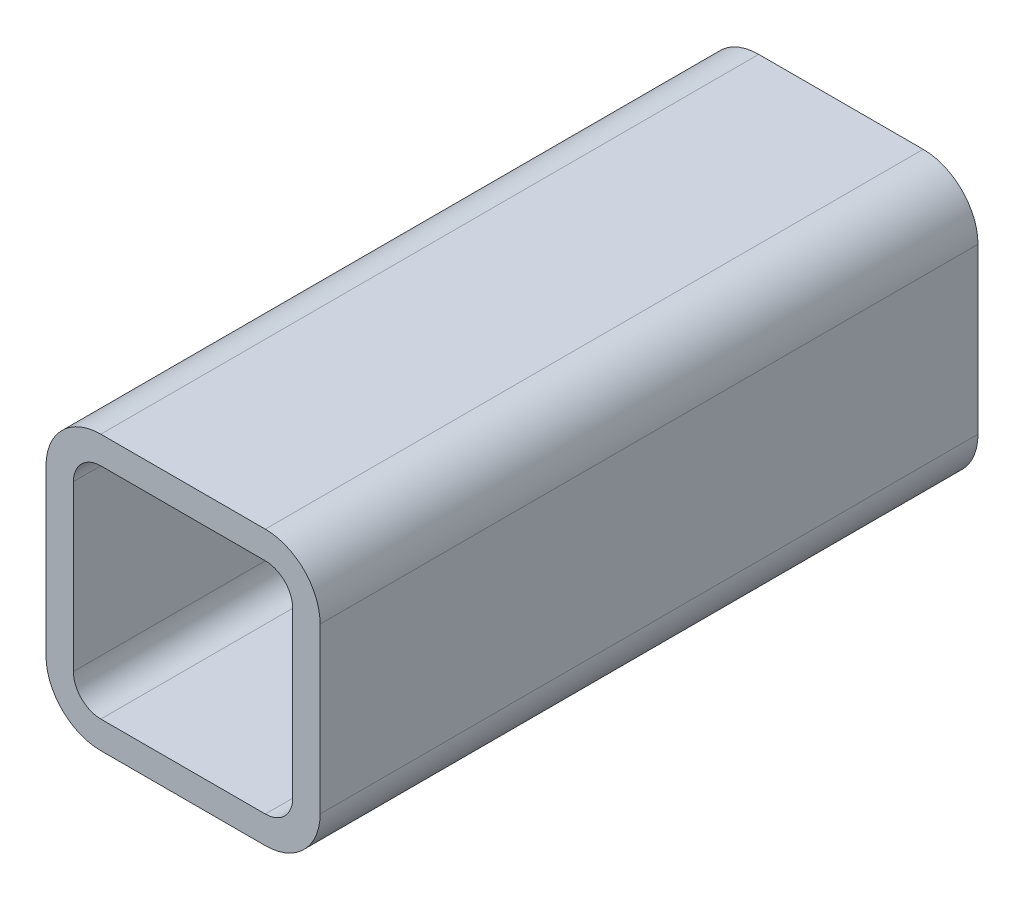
ISO-10303-21;
HEADER;
FILE_DESCRIPTION(('STEP AP214'),'2;1');
FILE_NAME('part.step','',(''),(''),'','','');
FILE_SCHEMA(('AUTOMOTIVE_DESIGN { 1 0 10303 214 1 1 1 1 }'));
ENDSEC;
DATA;
#1=APPLICATION_CONTEXT('core data for automotive mechanical design processes');
#2=APPLICATION_PROTOCOL_DEFINITION('international standard','automotive_design',2000,#1);
#3=PRODUCT_CONTEXT('',#1,'mechanical');
#4=PRODUCT('Part','Part','',(#3));
#5=PRODUCT_RELATED_PRODUCT_CATEGORY('part','',(#4));
#6=PRODUCT_DEFINITION_FORMATION('','',#4);
#7=PRODUCT_DEFINITION_CONTEXT('part definition',#1,'design');
#8=PRODUCT_DEFINITION('design','',#6,#7);
#9=PRODUCT_DEFINITION_SHAPE('','',#8);
#10=(LENGTH_UNIT() NAMED_UNIT(*) SI_UNIT(.MILLI.,.METRE.));
#11=(NAMED_UNIT(*) PLANE_ANGLE_UNIT() SI_UNIT($,.RADIAN.));
#12=(NAMED_UNIT(*) SI_UNIT($,.STERADIAN.) SOLID_ANGLE_UNIT());
#13=UNCERTAINTY_MEASURE_WITH_UNIT(LENGTH_MEASURE(1.E-05),#10,'distance_accuracy_value','');
#14=(GEOMETRIC_REPRESENTATION_CONTEXT(3) GLOBAL_UNCERTAINTY_ASSIGNED_CONTEXT((#13)) GLOBAL_UNIT_ASSIGNED_CONTEXT((#10,
#11,#12)) REPRESENTATION_CONTEXT('',''));
#15=CARTESIAN_POINT('',(0.,0.,0.));
#16=DIRECTION('',(0.,0.,1.));
#17=DIRECTION('',(1.,0.,0.));
#18=AXIS2_PLACEMENT_3D('',#15,#16,#17);
#19=CARTESIAN_POINT('',(26.2612396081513,103.63485662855,304.8));
#20=DIRECTION('',(0.,0.,1.));
#21=DIRECTION('',(1.,0.,0.));
#22=AXIS2_PLACEMENT_3D('',#19,#20,#21);
#23=PLANE('',#22);
#24=CARTESIAN_POINT('',(26.2612396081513,103.63485662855,304.8));
#25=DIRECTION('',(0.,0.,1.));
#26=DIRECTION('',(1.,0.,0.));
#27=AXIS2_PLACEMENT_3D('',#24,#25,#26);
#28=CIRCLE('',#27,25.4);
#29=CARTESIAN_POINT('',(26.2612396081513,129.03485662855,304.8));
#30=VERTEX_POINT('',#29);
#31=CARTESIAN_POINT('',(0.8612396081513,103.63485662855,304.8));
#32=VERTEX_POINT('',#31);
#33=EDGE_CURVE('E211',#30,#32,#28,.T.);
#34=ORIENTED_EDGE('',*,*,#33,.T.);
#35=DIRECTION('',(0.,-1.,0.));
#36=VECTOR('',#35,1.);
#37=CARTESIAN_POINT('',(0.8612396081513,27.4348566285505,304.8));
#38=LINE('',#37,#36);
#39=CARTESIAN_POINT('',(0.861239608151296,27.4348566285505,304.8));
#40=VERTEX_POINT('',#39);
#41=EDGE_CURVE('E214',#32,#40,#38,.T.);
#42=ORIENTED_EDGE('',*,*,#41,.T.);
#43=CARTESIAN_POINT('',(26.2612396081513,27.4348566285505,304.8));
#44=DIRECTION('',(0.,0.,1.));
#45=DIRECTION('',(1.,0.,0.));
#46=AXIS2_PLACEMENT_3D('',#43,#44,#45);
#47=CIRCLE('',#46,25.4);
#48=CARTESIAN_POINT('',(26.2612396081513,2.03485662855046,304.8));
#49=VERTEX_POINT('',#48);
#50=EDGE_CURVE('E217',#40,#49,#47,.T.);
#51=ORIENTED_EDGE('',*,*,#50,.T.);
#52=DIRECTION('',(1.,0.,0.));
#53=VECTOR('',#52,1.);
#54=CARTESIAN_POINT('',(102.461239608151,2.03485662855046,304.8));
#55=LINE('',#54,#53);
#56=CARTESIAN_POINT('',(102.461239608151,2.03485662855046,304.8));
#57=VERTEX_POINT('',#56);
#58=EDGE_CURVE('E219',#49,#57,#55,.T.);
#59=ORIENTED_EDGE('',*,*,#58,.T.);
#60=CARTESIAN_POINT('',(102.461239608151,27.4348566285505,304.8));
#61=DIRECTION('',(0.,0.,1.));
#62=DIRECTION('',(1.,0.,0.));
#63=AXIS2_PLACEMENT_3D('',#60,#61,#62);
#64=CIRCLE('',#63,25.4);
#65=CARTESIAN_POINT('',(127.861239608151,27.4348566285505,304.8));
#66=VERTEX_POINT('',#65);
#67=EDGE_CURVE('E221',#57,#66,#64,.T.);
#68=ORIENTED_EDGE('',*,*,#67,.T.);
#69=DIRECTION('',(0.,1.,0.));
#70=VECTOR('',#69,1.);
#71=CARTESIAN_POINT('',(127.861239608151,103.63485662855,304.8));
#72=LINE('',#71,#70);
#73=CARTESIAN_POINT('',(127.861239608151,103.63485662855,304.8));
#74=VERTEX_POINT('',#73);
#75=EDGE_CURVE('E223',#66,#74,#72,.T.);
#76=ORIENTED_EDGE('',*,*,#75,.T.);
#77=CARTESIAN_POINT('',(102.461239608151,103.63485662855,304.8));
#78=DIRECTION('',(0.,0.,1.));
#79=DIRECTION('',(1.,0.,0.));
#80=AXIS2_PLACEMENT_3D('',#77,#78,#79);
#81=CIRCLE('',#80,25.4);
#82=CARTESIAN_POINT('',(102.461239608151,129.03485662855,304.8));
#83=VERTEX_POINT('',#82);
#84=EDGE_CURVE('E225',#74,#83,#81,.T.);
#85=ORIENTED_EDGE('',*,*,#84,.T.);
#86=DIRECTION('',(-1.,0.,0.));
#87=VECTOR('',#86,1.);
#88=CARTESIAN_POINT('',(26.2612396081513,129.03485662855,304.8));
#89=LINE('',#88,#87);
#90=EDGE_CURVE('E227',#83,#30,#89,.T.);
#91=ORIENTED_EDGE('',*,*,#90,.T.);
#92=EDGE_LOOP('',(#34,#42,#51,#59,#68,#76,#85,#91));
#93=FACE_BOUND('',#92,.T.);
#94=DIRECTION('',(0.,-1.,0.));
#95=VECTOR('',#94,1.);
#96=CARTESIAN_POINT('',(13.5612396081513,27.4348566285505,304.8));
#97=LINE('',#96,#95);
#98=CARTESIAN_POINT('',(13.5612396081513,103.63485662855,304.8));
#99=VERTEX_POINT('',#98);
#100=CARTESIAN_POINT('',(13.5612396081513,27.4348566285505,304.8));
#101=VERTEX_POINT('',#100);
#102=EDGE_CURVE('E154',#99,#101,#97,.T.);
#103=ORIENTED_EDGE('',*,*,#102,.F.);
#104=CARTESIAN_POINT('',(26.2612396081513,103.63485662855,304.8));
#105=DIRECTION('',(0.,0.,1.));
#106=DIRECTION('',(1.,0.,0.));
#107=AXIS2_PLACEMENT_3D('',#104,#105,#106);
#108=CIRCLE('',#107,12.7);
#109=CARTESIAN_POINT('',(26.2612396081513,116.33485662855,304.8));
#110=VERTEX_POINT('',#109);
#111=EDGE_CURVE('E146',#110,#99,#108,.T.);
#112=ORIENTED_EDGE('',*,*,#111,.F.);
#113=DIRECTION('',(-1.,0.,0.));
#114=VECTOR('',#113,1.);
#115=CARTESIAN_POINT('',(26.2612396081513,116.33485662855,304.8));
#116=LINE('',#115,#114);
#117=CARTESIAN_POINT('',(102.461239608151,116.33485662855,304.8));
#118=VERTEX_POINT('',#117);
#119=EDGE_CURVE('E179',#118,#110,#116,.T.);
#120=ORIENTED_EDGE('',*,*,#119,.F.);
#121=CARTESIAN_POINT('',(102.461239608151,103.63485662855,304.8));
#122=DIRECTION('',(0.,0.,1.));
#123=DIRECTION('',(1.,0.,0.));
#124=AXIS2_PLACEMENT_3D('',#121,#122,#123);
#125=CIRCLE('',#124,12.7);
#126=CARTESIAN_POINT('',(115.161239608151,103.63485662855,304.8));
#127=VERTEX_POINT('',#126);
#128=EDGE_CURVE('E177',#127,#118,#125,.T.);
#129=ORIENTED_EDGE('',*,*,#128,.F.);
#130=DIRECTION('',(0.,1.,0.));
#131=VECTOR('',#130,1.);
#132=CARTESIAN_POINT('',(115.161239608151,103.63485662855,304.8));
#133=LINE('',#132,#131);
#134=CARTESIAN_POINT('',(115.161239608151,27.4348566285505,304.8));
#135=VERTEX_POINT('',#134);
#136=EDGE_CURVE('E175',#135,#127,#133,.T.);
#137=ORIENTED_EDGE('',*,*,#136,.F.);
#138=CARTESIAN_POINT('',(102.461239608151,27.4348566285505,304.8));
#139=DIRECTION('',(0.,0.,1.));
#140=DIRECTION('',(1.,0.,0.));
#141=AXIS2_PLACEMENT_3D('',#138,#139,#140);
#142=CIRCLE('',#141,12.7);
#143=CARTESIAN_POINT('',(102.461239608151,14.7348566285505,304.8));
#144=VERTEX_POINT('',#143);
#145=EDGE_CURVE('E173',#144,#135,#142,.T.);
#146=ORIENTED_EDGE('',*,*,#145,.F.);
#147=DIRECTION('',(1.,0.,0.));
#148=VECTOR('',#147,1.);
#149=CARTESIAN_POINT('',(102.461239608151,14.7348566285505,304.8));
#150=LINE('',#149,#148);
#151=CARTESIAN_POINT('',(26.2612396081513,14.7348566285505,304.8));
#152=VERTEX_POINT('',#151);
#153=EDGE_CURVE('E169',#152,#144,#150,.T.);
#154=ORIENTED_EDGE('',*,*,#153,.F.);
#155=CARTESIAN_POINT('',(26.2612396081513,27.4348566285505,304.8));
#156=DIRECTION('',(0.,0.,1.));
#157=DIRECTION('',(1.,0.,0.));
#158=AXIS2_PLACEMENT_3D('',#155,#156,#157);
#159=CIRCLE('',#158,12.7);
#160=EDGE_CURVE('E167',#101,#152,#159,.T.);
#161=ORIENTED_EDGE('',*,*,#160,.F.);
#162=EDGE_LOOP('',(#103,#112,#120,#129,#137,#146,#154,#161));
#163=FACE_BOUND('',#162,.T.);
#164=ADVANCED_FACE('F33',(#93,#163),#23,.T.);
#165=CARTESIAN_POINT('',(26.2612396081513,103.63485662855,0.));
#166=DIRECTION('',(0.,0.,1.));
#167=DIRECTION('',(1.,0.,0.));
#168=AXIS2_PLACEMENT_3D('',#165,#166,#167);
#169=PLANE('',#168);
#170=CARTESIAN_POINT('',(26.2612396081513,103.63485662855,0.));
#171=DIRECTION('',(0.,0.,1.));
#172=DIRECTION('',(1.,0.,0.));
#173=AXIS2_PLACEMENT_3D('',#170,#171,#172);
#174=CIRCLE('',#173,25.4);
#175=CARTESIAN_POINT('',(26.2612396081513,129.03485662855,0.));
#176=VERTEX_POINT('',#175);
#177=CARTESIAN_POINT('',(0.8612396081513,103.63485662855,0.));
#178=VERTEX_POINT('',#177);
#179=EDGE_CURVE('E162',#176,#178,#174,.T.);
#180=ORIENTED_EDGE('',*,*,#179,.F.);
#181=DIRECTION('',(-1.,0.,0.));
#182=VECTOR('',#181,1.);
#183=CARTESIAN_POINT('',(26.2612396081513,129.03485662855,0.));
#184=LINE('',#183,#182);
#185=CARTESIAN_POINT('',(102.461239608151,129.03485662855,0.));
#186=VERTEX_POINT('',#185);
#187=EDGE_CURVE('E215',#186,#176,#184,.T.);
#188=ORIENTED_EDGE('',*,*,#187,.F.);
#189=CARTESIAN_POINT('',(102.461239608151,103.63485662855,0.));
#190=DIRECTION('',(0.,0.,1.));
#191=DIRECTION('',(1.,0.,0.));
#192=AXIS2_PLACEMENT_3D('',#189,#190,#191);
#193=CIRCLE('',#192,25.4);
#194=CARTESIAN_POINT('',(127.861239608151,103.63485662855,0.));
#195=VERTEX_POINT('',#194);
#196=EDGE_CURVE('E242',#195,#186,#193,.T.);
#197=ORIENTED_EDGE('',*,*,#196,.F.);
#198=DIRECTION('',(0.,1.,0.));
#199=VECTOR('',#198,1.);
#200=CARTESIAN_POINT('',(127.861239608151,103.63485662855,0.));
#201=LINE('',#200,#199);
#202=CARTESIAN_POINT('',(127.861239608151,27.4348566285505,0.));
#203=VERTEX_POINT('',#202);
#204=EDGE_CURVE('E240',#203,#195,#201,.T.);
#205=ORIENTED_EDGE('',*,*,#204,.F.);
#206=CARTESIAN_POINT('',(102.461239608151,27.4348566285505,0.));
#207=DIRECTION('',(0.,0.,1.));
#208=DIRECTION('',(1.,0.,0.));
#209=AXIS2_PLACEMENT_3D('',#206,#207,#208);
#210=CIRCLE('',#209,25.4);
#211=CARTESIAN_POINT('',(102.461239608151,2.03485662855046,0.));
#212=VERTEX_POINT('',#211);
#213=EDGE_CURVE('E238',#212,#203,#210,.T.);
#214=ORIENTED_EDGE('',*,*,#213,.F.);
#215=DIRECTION('',(1.,0.,0.));
#216=VECTOR('',#215,1.);
#217=CARTESIAN_POINT('',(102.461239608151,2.03485662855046,0.));
#218=LINE('',#217,#216);
#219=CARTESIAN_POINT('',(26.2612396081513,2.03485662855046,0.));
#220=VERTEX_POINT('',#219);
#221=EDGE_CURVE('E236',#220,#212,#218,.T.);
#222=ORIENTED_EDGE('',*,*,#221,.F.);
#223=CARTESIAN_POINT('',(26.2612396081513,27.4348566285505,0.));
#224=DIRECTION('',(0.,0.,1.));
#225=DIRECTION('',(1.,0.,0.));
#226=AXIS2_PLACEMENT_3D('',#223,#224,#225);
#227=CIRCLE('',#226,25.4);
#228=CARTESIAN_POINT('',(0.861239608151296,27.4348566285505,0.));
#229=VERTEX_POINT('',#228);
#230=EDGE_CURVE('E234',#229,#220,#227,.T.);
#231=ORIENTED_EDGE('',*,*,#230,.F.);
#232=DIRECTION('',(0.,-1.,0.));
#233=VECTOR('',#232,1.);
#234=CARTESIAN_POINT('',(0.8612396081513,27.4348566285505,0.));
#235=LINE('',#234,#233);
#236=EDGE_CURVE('E232',#178,#229,#235,.T.);
#237=ORIENTED_EDGE('',*,*,#236,.F.);
#238=EDGE_LOOP('',(#180,#188,#197,#205,#214,#222,#231,#237));
#239=FACE_BOUND('',#238,.T.);
#240=CARTESIAN_POINT('',(26.2612396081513,103.63485662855,0.));
#241=DIRECTION('',(0.,0.,1.));
#242=DIRECTION('',(1.,0.,0.));
#243=AXIS2_PLACEMENT_3D('',#240,#241,#242);
#244=CIRCLE('',#243,12.7);
#245=CARTESIAN_POINT('',(26.2612396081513,116.33485662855,0.));
#246=VERTEX_POINT('',#245);
#247=CARTESIAN_POINT('',(13.5612396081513,103.63485662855,0.));
#248=VERTEX_POINT('',#247);
#249=EDGE_CURVE('E56',#246,#248,#244,.T.);
#250=ORIENTED_EDGE('',*,*,#249,.T.);
#251=DIRECTION('',(0.,-1.,0.));
#252=VECTOR('',#251,1.);
#253=CARTESIAN_POINT('',(13.5612396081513,27.4348566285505,0.));
#254=LINE('',#253,#252);
#255=CARTESIAN_POINT('',(13.5612396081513,27.4348566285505,0.));
#256=VERTEX_POINT('',#255);
#257=EDGE_CURVE('E161',#248,#256,#254,.T.);
#258=ORIENTED_EDGE('',*,*,#257,.T.);
#259=CARTESIAN_POINT('',(26.2612396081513,27.4348566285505,0.));
#260=DIRECTION('',(0.,0.,1.));
#261=DIRECTION('',(1.,0.,0.));
#262=AXIS2_PLACEMENT_3D('',#259,#260,#261);
#263=CIRCLE('',#262,12.7);
#264=CARTESIAN_POINT('',(26.2612396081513,14.7348566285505,0.));
#265=VERTEX_POINT('',#264);
#266=EDGE_CURVE('E183',#256,#265,#263,.T.);
#267=ORIENTED_EDGE('',*,*,#266,.T.);
#268=DIRECTION('',(1.,0.,0.));
#269=VECTOR('',#268,1.);
#270=CARTESIAN_POINT('',(102.461239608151,14.7348566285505,0.));
#271=LINE('',#270,#269);
#272=CARTESIAN_POINT('',(102.461239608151,14.7348566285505,0.));
#273=VERTEX_POINT('',#272);
#274=EDGE_CURVE('E186',#265,#273,#271,.T.);
#275=ORIENTED_EDGE('',*,*,#274,.T.);
#276=CARTESIAN_POINT('',(102.461239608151,27.4348566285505,0.));
#277=DIRECTION('',(0.,0.,1.));
#278=DIRECTION('',(1.,0.,0.));
#279=AXIS2_PLACEMENT_3D('',#276,#277,#278);
#280=CIRCLE('',#279,12.7);
#281=CARTESIAN_POINT('',(115.161239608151,27.4348566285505,0.));
#282=VERTEX_POINT('',#281);
#283=EDGE_CURVE('E189',#273,#282,#280,.T.);
#284=ORIENTED_EDGE('',*,*,#283,.T.);
#285=DIRECTION('',(0.,1.,0.));
#286=VECTOR('',#285,1.);
#287=CARTESIAN_POINT('',(115.161239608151,103.63485662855,0.));
#288=LINE('',#287,#286);
#289=CARTESIAN_POINT('',(115.161239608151,103.63485662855,0.));
#290=VERTEX_POINT('',#289);
#291=EDGE_CURVE('E192',#282,#290,#288,.T.);
#292=ORIENTED_EDGE('',*,*,#291,.T.);
#293=CARTESIAN_POINT('',(102.461239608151,103.63485662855,0.));
#294=DIRECTION('',(0.,0.,1.));
#295=DIRECTION('',(1.,0.,0.));
#296=AXIS2_PLACEMENT_3D('',#293,#294,#295);
#297=CIRCLE('',#296,12.7);
#298=CARTESIAN_POINT('',(102.461239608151,116.33485662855,0.));
#299=VERTEX_POINT('',#298);
#300=EDGE_CURVE('E195',#290,#299,#297,.T.);
#301=ORIENTED_EDGE('',*,*,#300,.T.);
#302=DIRECTION('',(-1.,0.,0.));
#303=VECTOR('',#302,1.);
#304=CARTESIAN_POINT('',(26.2612396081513,116.33485662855,0.));
#305=LINE('',#304,#303);
#306=EDGE_CURVE('E155',#299,#246,#305,.T.);
#307=ORIENTED_EDGE('',*,*,#306,.T.);
#308=EDGE_LOOP('',(#250,#258,#267,#275,#284,#292,#301,#307));
#309=FACE_BOUND('',#308,.T.);
#310=ADVANCED_FACE('F272',(#239,#309),#169,.F.);
#311=CARTESIAN_POINT('',(26.2612396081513,103.63485662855,304.8));
#312=DIRECTION('',(0.,0.,-1.));
#313=DIRECTION('',(-1.,0.,0.));
#314=AXIS2_PLACEMENT_3D('',#311,#312,#313);
#315=CYLINDRICAL_SURFACE('',#314,25.4);
#316=ORIENTED_EDGE('',*,*,#179,.T.);
#317=DIRECTION('',(0.,0.,-1.));
#318=VECTOR('',#317,1.);
#319=CARTESIAN_POINT('',(0.8612396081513,103.63485662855,304.8));
#320=LINE('',#319,#318);
#321=EDGE_CURVE('E11',#32,#178,#320,.T.);
#322=ORIENTED_EDGE('',*,*,#321,.F.);
#323=ORIENTED_EDGE('',*,*,#33,.F.);
#324=DIRECTION('',(0.,0.,-1.));
#325=VECTOR('',#324,1.);
#326=CARTESIAN_POINT('',(26.2612396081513,129.03485662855,304.8));
#327=LINE('',#326,#325);
#328=EDGE_CURVE('E229',#30,#176,#327,.T.);
#329=ORIENTED_EDGE('',*,*,#328,.T.);
#330=EDGE_LOOP('',(#316,#322,#323,#329));
#331=FACE_BOUND('',#330,.T.);
#332=ADVANCED_FACE('F35',(#331),#315,.T.);
#333=CARTESIAN_POINT('',(0.8612396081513,27.4348566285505,304.8));
#334=DIRECTION('',(1.,0.,0.));
#335=DIRECTION('',(0.,0.,-1.));
#336=AXIS2_PLACEMENT_3D('',#333,#334,#335);
#337=PLANE('',#336);
#338=ORIENTED_EDGE('',*,*,#236,.T.);
#339=DIRECTION('',(0.,0.,-1.));
#340=VECTOR('',#339,1.);
#341=CARTESIAN_POINT('',(0.861239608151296,27.4348566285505,304.8));
#342=LINE('',#341,#340);
#343=EDGE_CURVE('E41',#40,#229,#342,.T.);
#344=ORIENTED_EDGE('',*,*,#343,.F.);
#345=ORIENTED_EDGE('',*,*,#41,.F.);
#346=ORIENTED_EDGE('',*,*,#321,.T.);
#347=EDGE_LOOP('',(#338,#344,#345,#346));
#348=FACE_BOUND('',#347,.T.);
#349=ADVANCED_FACE('F289',(#348),#337,.F.);
#350=CARTESIAN_POINT('',(26.2612396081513,27.4348566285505,304.8));
#351=DIRECTION('',(0.,0.,-1.));
#352=DIRECTION('',(-1.,0.,0.));
#353=AXIS2_PLACEMENT_3D('',#350,#351,#352);
#354=CYLINDRICAL_SURFACE('',#353,25.4);
#355=ORIENTED_EDGE('',*,*,#230,.T.);
#356=DIRECTION('',(0.,0.,-1.));
#357=VECTOR('',#356,1.);
#358=CARTESIAN_POINT('',(26.2612396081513,2.03485662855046,304.8));
#359=LINE('',#358,#357);
#360=EDGE_CURVE('E259',#49,#220,#359,.T.);
#361=ORIENTED_EDGE('',*,*,#360,.F.);
#362=ORIENTED_EDGE('',*,*,#50,.F.);
#363=ORIENTED_EDGE('',*,*,#343,.T.);
#364=EDGE_LOOP('',(#355,#361,#362,#363));
#365=FACE_BOUND('',#364,.T.);
#366=ADVANCED_FACE('F266',(#365),#354,.T.);
#367=CARTESIAN_POINT('',(102.461239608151,2.03485662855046,304.8));
#368=DIRECTION('',(0.,1.,0.));
#369=DIRECTION('',(0.,0.,1.));
#370=AXIS2_PLACEMENT_3D('',#367,#368,#369);
#371=PLANE('',#370);
#372=ORIENTED_EDGE('',*,*,#221,.T.);
#373=DIRECTION('',(0.,0.,-1.));
#374=VECTOR('',#373,1.);
#375=CARTESIAN_POINT('',(102.461239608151,2.03485662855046,304.8));
#376=LINE('',#375,#374);
#377=EDGE_CURVE('E256',#57,#212,#376,.T.);
#378=ORIENTED_EDGE('',*,*,#377,.F.);
#379=ORIENTED_EDGE('',*,*,#58,.F.);
#380=ORIENTED_EDGE('',*,*,#360,.T.);
#381=EDGE_LOOP('',(#372,#378,#379,#380));
#382=FACE_BOUND('',#381,.T.);
#383=ADVANCED_FACE('F278',(#382),#371,.F.);
#384=CARTESIAN_POINT('',(102.461239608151,27.4348566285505,304.8));
#385=DIRECTION('',(0.,0.,-1.));
#386=DIRECTION('',(-1.,0.,0.));
#387=AXIS2_PLACEMENT_3D('',#384,#385,#386);
#388=CYLINDRICAL_SURFACE('',#387,25.4);
#389=ORIENTED_EDGE('',*,*,#213,.T.);
#390=DIRECTION('',(0.,0.,-1.));
#391=VECTOR('',#390,1.);
#392=CARTESIAN_POINT('',(127.861239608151,27.4348566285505,304.8));
#393=LINE('',#392,#391);
#394=EDGE_CURVE('E253',#66,#203,#393,.T.);
#395=ORIENTED_EDGE('',*,*,#394,.F.);
#396=ORIENTED_EDGE('',*,*,#67,.F.);
#397=ORIENTED_EDGE('',*,*,#377,.T.);
#398=EDGE_LOOP('',(#389,#395,#396,#397));
#399=FACE_BOUND('',#398,.T.);
#400=ADVANCED_FACE('F282',(#399),#388,.T.);
#401=CARTESIAN_POINT('',(127.861239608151,103.63485662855,304.8));
#402=DIRECTION('',(-1.,0.,0.));
#403=DIRECTION('',(0.,0.,1.));
#404=AXIS2_PLACEMENT_3D('',#401,#402,#403);
#405=PLANE('',#404);
#406=ORIENTED_EDGE('',*,*,#204,.T.);
#407=DIRECTION('',(0.,0.,-1.));
#408=VECTOR('',#407,1.);
#409=CARTESIAN_POINT('',(127.861239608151,103.63485662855,304.8));
#410=LINE('',#409,#408);
#411=EDGE_CURVE('E250',#74,#195,#410,.T.);
#412=ORIENTED_EDGE('',*,*,#411,.F.);
#413=ORIENTED_EDGE('',*,*,#75,.F.);
#414=ORIENTED_EDGE('',*,*,#394,.T.);
#415=EDGE_LOOP('',(#406,#412,#413,#414));
#416=FACE_BOUND('',#415,.T.);
#417=ADVANCED_FACE('F302',(#416),#405,.F.);
#418=CARTESIAN_POINT('',(102.461239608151,103.63485662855,304.8));
#419=DIRECTION('',(0.,0.,-1.));
#420=DIRECTION('',(-1.,0.,0.));
#421=AXIS2_PLACEMENT_3D('',#418,#419,#420);
#422=CYLINDRICAL_SURFACE('',#421,25.4);
#423=ORIENTED_EDGE('',*,*,#196,.T.);
#424=DIRECTION('',(0.,0.,-1.));
#425=VECTOR('',#424,1.);
#426=CARTESIAN_POINT('',(102.461239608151,129.03485662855,304.8));
#427=LINE('',#426,#425);
#428=EDGE_CURVE('E247',#83,#186,#427,.T.);
#429=ORIENTED_EDGE('',*,*,#428,.F.);
#430=ORIENTED_EDGE('',*,*,#84,.F.);
#431=ORIENTED_EDGE('',*,*,#411,.T.);
#432=EDGE_LOOP('',(#423,#429,#430,#431));
#433=FACE_BOUND('',#432,.T.);
#434=ADVANCED_FACE('F300',(#433),#422,.T.);
#435=CARTESIAN_POINT('',(26.2612396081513,129.03485662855,304.8));
#436=DIRECTION('',(0.,-1.,0.));
#437=DIRECTION('',(0.,0.,-1.));
#438=AXIS2_PLACEMENT_3D('',#435,#436,#437);
#439=PLANE('',#438);
#440=ORIENTED_EDGE('',*,*,#187,.T.);
#441=ORIENTED_EDGE('',*,*,#328,.F.);
#442=ORIENTED_EDGE('',*,*,#90,.F.);
#443=ORIENTED_EDGE('',*,*,#428,.T.);
#444=EDGE_LOOP('',(#440,#441,#442,#443));
#445=FACE_BOUND('',#444,.T.);
#446=ADVANCED_FACE('F295',(#445),#439,.F.);
#447=CARTESIAN_POINT('',(26.2612396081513,103.63485662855,304.8));
#448=DIRECTION('',(0.,0.,-1.));
#449=DIRECTION('',(-1.,0.,0.));
#450=AXIS2_PLACEMENT_3D('',#447,#448,#449);
#451=CYLINDRICAL_SURFACE('',#450,12.7);
#452=ORIENTED_EDGE('',*,*,#249,.F.);
#453=DIRECTION('',(0.,0.,-1.));
#454=VECTOR('',#453,1.);
#455=CARTESIAN_POINT('',(26.2612396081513,116.33485662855,304.8));
#456=LINE('',#455,#454);
#457=EDGE_CURVE('E150',#110,#246,#456,.T.);
#458=ORIENTED_EDGE('',*,*,#457,.F.);
#459=ORIENTED_EDGE('',*,*,#111,.T.);
#460=DIRECTION('',(0.,0.,-1.));
#461=VECTOR('',#460,1.);
#462=CARTESIAN_POINT('',(13.5612396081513,103.63485662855,304.8));
#463=LINE('',#462,#461);
#464=EDGE_CURVE('E149',#99,#248,#463,.T.);
#465=ORIENTED_EDGE('',*,*,#464,.T.);
#466=EDGE_LOOP('',(#452,#458,#459,#465));
#467=FACE_BOUND('',#466,.T.);
#468=ADVANCED_FACE('F148',(#467),#451,.F.);
#469=CARTESIAN_POINT('',(13.5612396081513,27.4348566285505,304.8));
#470=DIRECTION('',(1.,0.,0.));
#471=DIRECTION('',(0.,0.,-1.));
#472=AXIS2_PLACEMENT_3D('',#469,#470,#471);
#473=PLANE('',#472);
#474=ORIENTED_EDGE('',*,*,#257,.F.);
#475=ORIENTED_EDGE('',*,*,#464,.F.);
#476=ORIENTED_EDGE('',*,*,#102,.T.);
#477=DIRECTION('',(0.,0.,-1.));
#478=VECTOR('',#477,1.);
#479=CARTESIAN_POINT('',(13.5612396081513,27.4348566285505,304.8));
#480=LINE('',#479,#478);
#481=EDGE_CURVE('E163',#101,#256,#480,.T.);
#482=ORIENTED_EDGE('',*,*,#481,.T.);
#483=EDGE_LOOP('',(#474,#475,#476,#482));
#484=FACE_BOUND('',#483,.T.);
#485=ADVANCED_FACE('F158',(#484),#473,.T.);
#486=CARTESIAN_POINT('',(26.2612396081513,27.4348566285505,304.8));
#487=DIRECTION('',(0.,0.,-1.));
#488=DIRECTION('',(-1.,0.,0.));
#489=AXIS2_PLACEMENT_3D('',#486,#487,#488);
#490=CYLINDRICAL_SURFACE('',#489,12.7);
#491=ORIENTED_EDGE('',*,*,#266,.F.);
#492=ORIENTED_EDGE('',*,*,#481,.F.);
#493=ORIENTED_EDGE('',*,*,#160,.T.);
#494=DIRECTION('',(0.,0.,-1.));
#495=VECTOR('',#494,1.);
#496=CARTESIAN_POINT('',(26.2612396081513,14.7348566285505,304.8));
#497=LINE('',#496,#495);
#498=EDGE_CURVE('E208',#152,#265,#497,.T.);
#499=ORIENTED_EDGE('',*,*,#498,.T.);
#500=EDGE_LOOP('',(#491,#492,#493,#499));
#501=FACE_BOUND('',#500,.T.);
#502=ADVANCED_FACE('F327',(#501),#490,.F.);
#503=CARTESIAN_POINT('',(102.461239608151,14.7348566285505,304.8));
#504=DIRECTION('',(0.,1.,0.));
#505=DIRECTION('',(0.,0.,1.));
#506=AXIS2_PLACEMENT_3D('',#503,#504,#505);
#507=PLANE('',#506);
#508=ORIENTED_EDGE('',*,*,#274,.F.);
#509=ORIENTED_EDGE('',*,*,#498,.F.);
#510=ORIENTED_EDGE('',*,*,#153,.T.);
#511=DIRECTION('',(0.,0.,-1.));
#512=VECTOR('',#511,1.);
#513=CARTESIAN_POINT('',(102.461239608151,14.7348566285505,304.8));
#514=LINE('',#513,#512);
#515=EDGE_CURVE('E206',#144,#273,#514,.T.);
#516=ORIENTED_EDGE('',*,*,#515,.T.);
#517=EDGE_LOOP('',(#508,#509,#510,#516));
#518=FACE_BOUND('',#517,.T.);
#519=ADVANCED_FACE('F331',(#518),#507,.T.);
#520=CARTESIAN_POINT('',(102.461239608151,27.4348566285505,304.8));
#521=DIRECTION('',(0.,0.,-1.));
#522=DIRECTION('',(-1.,0.,0.));
#523=AXIS2_PLACEMENT_3D('',#520,#521,#522);
#524=CYLINDRICAL_SURFACE('',#523,12.7);
#525=ORIENTED_EDGE('',*,*,#283,.F.);
#526=ORIENTED_EDGE('',*,*,#515,.F.);
#527=ORIENTED_EDGE('',*,*,#145,.T.);
#528=DIRECTION('',(0.,0.,-1.));
#529=VECTOR('',#528,1.);
#530=CARTESIAN_POINT('',(115.161239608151,27.4348566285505,304.8));
#531=LINE('',#530,#529);
#532=EDGE_CURVE('E204',#135,#282,#531,.T.);
#533=ORIENTED_EDGE('',*,*,#532,.T.);
#534=EDGE_LOOP('',(#525,#526,#527,#533));
#535=FACE_BOUND('',#534,.T.);
#536=ADVANCED_FACE('F337',(#535),#524,.F.);
#537=CARTESIAN_POINT('',(115.161239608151,103.63485662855,304.8));
#538=DIRECTION('',(-1.,0.,0.));
#539=DIRECTION('',(0.,0.,1.));
#540=AXIS2_PLACEMENT_3D('',#537,#538,#539);
#541=PLANE('',#540);
#542=ORIENTED_EDGE('',*,*,#291,.F.);
#543=ORIENTED_EDGE('',*,*,#532,.F.);
#544=ORIENTED_EDGE('',*,*,#136,.T.);
#545=DIRECTION('',(0.,0.,-1.));
#546=VECTOR('',#545,1.);
#547=CARTESIAN_POINT('',(115.161239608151,103.63485662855,304.8));
#548=LINE('',#547,#546);
#549=EDGE_CURVE('E202',#127,#290,#548,.T.);
#550=ORIENTED_EDGE('',*,*,#549,.T.);
#551=EDGE_LOOP('',(#542,#543,#544,#550));
#552=FACE_BOUND('',#551,.T.);
#553=ADVANCED_FACE('F341',(#552),#541,.T.);
#554=CARTESIAN_POINT('',(102.461239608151,103.63485662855,304.8));
#555=DIRECTION('',(0.,0.,-1.));
#556=DIRECTION('',(-1.,0.,0.));
#557=AXIS2_PLACEMENT_3D('',#554,#555,#556);
#558=CYLINDRICAL_SURFACE('',#557,12.7);
#559=ORIENTED_EDGE('',*,*,#300,.F.);
#560=ORIENTED_EDGE('',*,*,#549,.F.);
#561=ORIENTED_EDGE('',*,*,#128,.T.);
#562=DIRECTION('',(0.,0.,-1.));
#563=VECTOR('',#562,1.);
#564=CARTESIAN_POINT('',(102.461239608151,116.33485662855,304.8));
#565=LINE('',#564,#563);
#566=EDGE_CURVE('E48',#118,#299,#565,.T.);
#567=ORIENTED_EDGE('',*,*,#566,.T.);
#568=EDGE_LOOP('',(#559,#560,#561,#567));
#569=FACE_BOUND('',#568,.T.);
#570=ADVANCED_FACE('F345',(#569),#558,.F.);
#571=CARTESIAN_POINT('',(26.2612396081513,116.33485662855,304.8));
#572=DIRECTION('',(0.,-1.,0.));
#573=DIRECTION('',(0.,0.,-1.));
#574=AXIS2_PLACEMENT_3D('',#571,#572,#573);
#575=PLANE('',#574);
#576=ORIENTED_EDGE('',*,*,#306,.F.);
#577=ORIENTED_EDGE('',*,*,#566,.F.);
#578=ORIENTED_EDGE('',*,*,#119,.T.);
#579=ORIENTED_EDGE('',*,*,#457,.T.);
#580=EDGE_LOOP('',(#576,#577,#578,#579));
#581=FACE_BOUND('',#580,.T.);
#582=ADVANCED_FACE('F349',(#581),#575,.T.);
#583=CLOSED_SHELL('',(#164,#310,#332,#349,#366,#383,#400,#417,#434,#446,#468,#485,#502,#519,
#536,#553,#570,#582));
#584=MANIFOLD_SOLID_BREP('B2',#583);
#585=ADVANCED_BREP_SHAPE_REPRESENTATION('',(#18,#584),#14);
#586=SHAPE_DEFINITION_REPRESENTATION(#9,#585);
ENDSEC;
END-ISO-10303-21;
